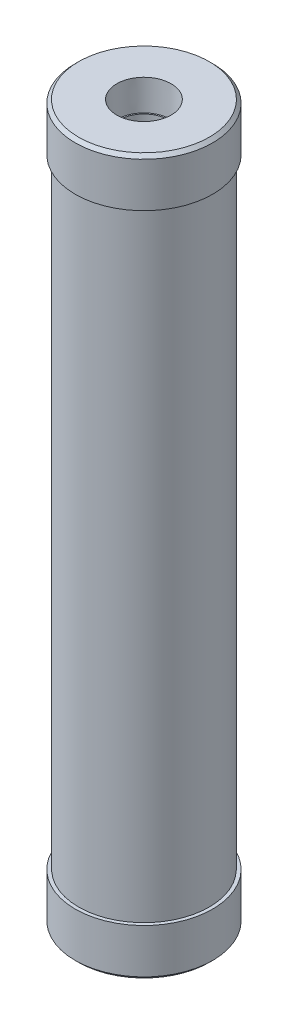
ISO-10303-21;
HEADER;
FILE_DESCRIPTION(('STEP AP214'),'2;1');
FILE_NAME('part.step','',(''),(''),'','','');
FILE_SCHEMA(('AUTOMOTIVE_DESIGN { 1 0 10303 214 1 1 1 1 }'));
ENDSEC;
DATA;
#1=APPLICATION_CONTEXT('core data for automotive mechanical design processes');
#2=APPLICATION_PROTOCOL_DEFINITION('international standard','automotive_design',2000,#1);
#3=PRODUCT_CONTEXT('',#1,'mechanical');
#4=PRODUCT('Part','Part','',(#3));
#5=PRODUCT_RELATED_PRODUCT_CATEGORY('part','',(#4));
#6=PRODUCT_DEFINITION_FORMATION('','',#4);
#7=PRODUCT_DEFINITION_CONTEXT('part definition',#1,'design');
#8=PRODUCT_DEFINITION('design','',#6,#7);
#9=PRODUCT_DEFINITION_SHAPE('','',#8);
#10=(LENGTH_UNIT() NAMED_UNIT(*) SI_UNIT(.MILLI.,.METRE.));
#11=(NAMED_UNIT(*) PLANE_ANGLE_UNIT() SI_UNIT($,.RADIAN.));
#12=(NAMED_UNIT(*) SI_UNIT($,.STERADIAN.) SOLID_ANGLE_UNIT());
#13=UNCERTAINTY_MEASURE_WITH_UNIT(LENGTH_MEASURE(1.E-05),#10,'distance_accuracy_value','');
#14=(GEOMETRIC_REPRESENTATION_CONTEXT(3) GLOBAL_UNCERTAINTY_ASSIGNED_CONTEXT((#13)) GLOBAL_UNIT_ASSIGNED_CONTEXT((#10,
#11,#12)) REPRESENTATION_CONTEXT('',''));
#15=CARTESIAN_POINT('',(0.,0.,0.));
#16=DIRECTION('',(0.,0.,1.));
#17=DIRECTION('',(1.,0.,0.));
#18=AXIS2_PLACEMENT_3D('',#15,#16,#17);
#19=CARTESIAN_POINT('',(0.,330.2,0.));
#20=DIRECTION('',(0.,-1.,0.));
#21=DIRECTION('',(0.,0.,-1.));
#22=AXIS2_PLACEMENT_3D('',#19,#20,#21);
#23=CYLINDRICAL_SURFACE('',#22,30.1625);
#24=CARTESIAN_POINT('',(0.,22.098,0.));
#25=DIRECTION('',(0.,1.,0.));
#26=DIRECTION('',(0.,0.,1.));
#27=AXIS2_PLACEMENT_3D('',#24,#25,#26);
#28=CIRCLE('',#27,30.1625);
#29=CARTESIAN_POINT('',(0.,22.098,30.1625));
#30=VERTEX_POINT('',#29);
#31=EDGE_CURVE('E82',#30,#30,#28,.T.);
#32=ORIENTED_EDGE('',*,*,#31,.T.);
#33=EDGE_LOOP('',(#32));
#34=FACE_BOUND('',#33,.T.);
#35=CARTESIAN_POINT('',(0.,308.102,0.));
#36=DIRECTION('',(0.,1.,0.));
#37=DIRECTION('',(0.,0.,1.));
#38=AXIS2_PLACEMENT_3D('',#35,#36,#37);
#39=CIRCLE('',#38,30.1625);
#40=CARTESIAN_POINT('',(0.,308.102,30.1625));
#41=VERTEX_POINT('',#40);
#42=EDGE_CURVE('E61',#41,#41,#39,.T.);
#43=ORIENTED_EDGE('',*,*,#42,.F.);
#44=EDGE_LOOP('',(#43));
#45=FACE_BOUND('',#44,.T.);
#46=ADVANCED_FACE('F33',(#34,#45),#23,.T.);
#47=CARTESIAN_POINT('',(0.,330.2,0.));
#48=DIRECTION('',(0.,-1.,0.));
#49=DIRECTION('',(0.,0.,-1.));
#50=AXIS2_PLACEMENT_3D('',#47,#48,#49);
#51=CYLINDRICAL_SURFACE('',#50,25.9969);
#52=CARTESIAN_POINT('',(0.,22.098,0.));
#53=DIRECTION('',(0.,1.,0.));
#54=DIRECTION('',(0.,0.,1.));
#55=AXIS2_PLACEMENT_3D('',#52,#53,#54);
#56=CIRCLE('',#55,25.9969);
#57=CARTESIAN_POINT('',(0.,22.098,25.9969));
#58=VERTEX_POINT('',#57);
#59=EDGE_CURVE('E53',#58,#58,#56,.T.);
#60=ORIENTED_EDGE('',*,*,#59,.F.);
#61=EDGE_LOOP('',(#60));
#62=FACE_BOUND('',#61,.T.);
#63=CARTESIAN_POINT('',(0.,308.102,0.));
#64=DIRECTION('',(0.,1.,0.));
#65=DIRECTION('',(0.,0.,1.));
#66=AXIS2_PLACEMENT_3D('',#63,#64,#65);
#67=CIRCLE('',#66,25.9969);
#68=CARTESIAN_POINT('',(0.,308.102,25.9969));
#69=VERTEX_POINT('',#68);
#70=EDGE_CURVE('E67',#69,#69,#67,.T.);
#71=ORIENTED_EDGE('',*,*,#70,.T.);
#72=EDGE_LOOP('',(#71));
#73=FACE_BOUND('',#72,.T.);
#74=ADVANCED_FACE('F117',(#62,#73),#51,.F.);
#75=CARTESIAN_POINT('',(0.,308.102,0.));
#76=DIRECTION('',(0.,1.,0.));
#77=DIRECTION('',(0.,0.,1.));
#78=AXIS2_PLACEMENT_3D('',#75,#76,#77);
#79=PLANE('',#78);
#80=CARTESIAN_POINT('',(0.,308.102,0.));
#81=DIRECTION('',(0.,1.,0.));
#82=DIRECTION('',(0.,0.,1.));
#83=AXIS2_PLACEMENT_3D('',#80,#81,#82);
#84=CIRCLE('',#83,11.5062);
#85=CARTESIAN_POINT('',(0.,308.102,11.5062));
#86=VERTEX_POINT('',#85);
#87=EDGE_CURVE('E62',#86,#86,#84,.T.);
#88=ORIENTED_EDGE('',*,*,#87,.T.);
#89=EDGE_LOOP('',(#88));
#90=FACE_BOUND('',#89,.T.);
#91=ORIENTED_EDGE('',*,*,#70,.F.);
#92=EDGE_LOOP('',(#91));
#93=FACE_BOUND('',#92,.T.);
#94=ADVANCED_FACE('F122',(#90,#93),#79,.F.);
#95=CARTESIAN_POINT('',(0.,308.102,0.));
#96=DIRECTION('',(0.,1.,0.));
#97=DIRECTION('',(0.,0.,1.));
#98=AXIS2_PLACEMENT_3D('',#95,#96,#97);
#99=CIRCLE('',#98,31.75);
#100=CARTESIAN_POINT('',(0.,308.102,31.75));
#101=VERTEX_POINT('',#100);
#102=EDGE_CURVE('E65',#101,#101,#99,.T.);
#103=ORIENTED_EDGE('',*,*,#102,.F.);
#104=EDGE_LOOP('',(#103));
#105=FACE_BOUND('',#104,.T.);
#106=ORIENTED_EDGE('',*,*,#42,.T.);
#107=EDGE_LOOP('',(#106));
#108=FACE_BOUND('',#107,.T.);
#109=ADVANCED_FACE('F168',(#105,#108),#79,.F.);
#110=CARTESIAN_POINT('',(0.,308.102,0.));
#111=DIRECTION('',(0.,1.,0.));
#112=DIRECTION('',(0.,0.,1.));
#113=AXIS2_PLACEMENT_3D('',#110,#111,#112);
#114=CYLINDRICAL_SURFACE('',#113,31.75);
#115=CARTESIAN_POINT('',(0.,328.676,0.));
#116=DIRECTION('',(0.,1.,0.));
#117=DIRECTION('',(0.,0.,1.));
#118=AXIS2_PLACEMENT_3D('',#115,#116,#117);
#119=CIRCLE('',#118,31.75);
#120=CARTESIAN_POINT('',(0.,328.676,31.75));
#121=VERTEX_POINT('',#120);
#122=EDGE_CURVE('E10',#121,#121,#119,.F.);
#123=ORIENTED_EDGE('',*,*,#122,.T.);
#124=EDGE_LOOP('',(#123));
#125=FACE_BOUND('',#124,.T.);
#126=ORIENTED_EDGE('',*,*,#102,.T.);
#127=EDGE_LOOP('',(#126));
#128=FACE_BOUND('',#127,.T.);
#129=ADVANCED_FACE('F170',(#125,#128),#114,.T.);
#130=CARTESIAN_POINT('',(0.,330.2,0.));
#131=DIRECTION('',(0.,1.,0.));
#132=DIRECTION('',(0.,0.,1.));
#133=AXIS2_PLACEMENT_3D('',#130,#131,#132);
#134=PLANE('',#133);
#135=CARTESIAN_POINT('',(0.,330.2,0.));
#136=DIRECTION('',(0.,1.,0.));
#137=DIRECTION('',(0.,0.,1.));
#138=AXIS2_PLACEMENT_3D('',#135,#136,#137);
#139=CIRCLE('',#138,30.226);
#140=CARTESIAN_POINT('',(0.,330.2,30.226));
#141=VERTEX_POINT('',#140);
#142=EDGE_CURVE('E40',#141,#141,#139,.T.);
#143=ORIENTED_EDGE('',*,*,#142,.T.);
#144=EDGE_LOOP('',(#143));
#145=FACE_BOUND('',#144,.T.);
#146=CARTESIAN_POINT('',(0.,330.2,0.));
#147=DIRECTION('',(0.,1.,0.));
#148=DIRECTION('',(0.,0.,1.));
#149=AXIS2_PLACEMENT_3D('',#146,#147,#148);
#150=CIRCLE('',#149,12.5561344);
#151=CARTESIAN_POINT('',(0.,330.2,12.5561344));
#152=VERTEX_POINT('',#151);
#153=EDGE_CURVE('E79',#152,#152,#150,.T.);
#154=ORIENTED_EDGE('',*,*,#153,.F.);
#155=EDGE_LOOP('',(#154));
#156=FACE_BOUND('',#155,.T.);
#157=ADVANCED_FACE('F164',(#145,#156),#134,.T.);
#158=CARTESIAN_POINT('',(0.,330.2,0.));
#159=DIRECTION('',(0.,1.,0.));
#160=DIRECTION('',(0.,0.,1.));
#161=AXIS2_PLACEMENT_3D('',#158,#159,#160);
#162=CYLINDRICAL_SURFACE('',#161,11.5062);
#163=CARTESIAN_POINT('',(0.,316.23,0.));
#164=DIRECTION('',(0.,1.,0.));
#165=DIRECTION('',(0.,0.,1.));
#166=AXIS2_PLACEMENT_3D('',#163,#164,#165);
#167=CIRCLE('',#166,11.5062);
#168=CARTESIAN_POINT('',(0.,316.23,11.5062));
#169=VERTEX_POINT('',#168);
#170=EDGE_CURVE('E66',#169,#169,#167,.T.);
#171=ORIENTED_EDGE('',*,*,#170,.T.);
#172=EDGE_LOOP('',(#171));
#173=FACE_BOUND('',#172,.T.);
#174=ORIENTED_EDGE('',*,*,#87,.F.);
#175=EDGE_LOOP('',(#174));
#176=FACE_BOUND('',#175,.T.);
#177=ADVANCED_FACE('F160',(#173,#176),#162,.F.);
#178=CARTESIAN_POINT('',(11.5062,316.23,0.));
#179=DIRECTION('',(0.,-1.,0.));
#180=DIRECTION('',(0.,0.,-1.));
#181=AXIS2_PLACEMENT_3D('',#178,#179,#180);
#182=PLANE('',#181);
#183=ORIENTED_EDGE('',*,*,#170,.F.);
#184=EDGE_LOOP('',(#183));
#185=FACE_BOUND('',#184,.T.);
#186=CARTESIAN_POINT('',(0.,316.23,0.));
#187=DIRECTION('',(0.,1.,0.));
#188=DIRECTION('',(0.,0.,1.));
#189=AXIS2_PLACEMENT_3D('',#186,#187,#188);
#190=CIRCLE('',#189,12.1378538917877);
#191=CARTESIAN_POINT('',(0.,316.23,12.1378538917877));
#192=VERTEX_POINT('',#191);
#193=EDGE_CURVE('E76',#192,#192,#190,.T.);
#194=ORIENTED_EDGE('',*,*,#193,.T.);
#195=EDGE_LOOP('',(#194));
#196=FACE_BOUND('',#195,.T.);
#197=ADVANCED_FACE('F156',(#185,#196),#182,.F.);
#198=CARTESIAN_POINT('',(0.,330.2,0.));
#199=DIRECTION('',(0.,1.,0.));
#200=DIRECTION('',(0.,0.,1.));
#201=AXIS2_PLACEMENT_3D('',#198,#199,#200);
#202=CONICAL_SURFACE('',#201,12.5561344,0.0299323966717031);
#203=ORIENTED_EDGE('',*,*,#193,.F.);
#204=EDGE_LOOP('',(#203));
#205=FACE_BOUND('',#204,.T.);
#206=ORIENTED_EDGE('',*,*,#153,.T.);
#207=EDGE_LOOP('',(#206));
#208=FACE_BOUND('',#207,.T.);
#209=ADVANCED_FACE('F150',(#205,#208),#202,.F.);
#210=CARTESIAN_POINT('',(0.,22.098,0.));
#211=DIRECTION('',(0.,1.,0.));
#212=DIRECTION('',(0.,0.,1.));
#213=AXIS2_PLACEMENT_3D('',#210,#211,#212);
#214=PLANE('',#213);
#215=CARTESIAN_POINT('',(0.,22.098,0.));
#216=DIRECTION('',(0.,1.,0.));
#217=DIRECTION('',(0.,0.,1.));
#218=AXIS2_PLACEMENT_3D('',#215,#216,#217);
#219=CIRCLE('',#218,11.5062);
#220=CARTESIAN_POINT('',(0.,22.098,11.5062));
#221=VERTEX_POINT('',#220);
#222=EDGE_CURVE('E54',#221,#221,#219,.T.);
#223=ORIENTED_EDGE('',*,*,#222,.F.);
#224=EDGE_LOOP('',(#223));
#225=FACE_BOUND('',#224,.T.);
#226=ORIENTED_EDGE('',*,*,#59,.T.);
#227=EDGE_LOOP('',(#226));
#228=FACE_BOUND('',#227,.T.);
#229=ADVANCED_FACE('F144',(#225,#228),#214,.T.);
#230=CARTESIAN_POINT('',(0.,22.098,0.));
#231=DIRECTION('',(0.,1.,0.));
#232=DIRECTION('',(0.,0.,1.));
#233=AXIS2_PLACEMENT_3D('',#230,#231,#232);
#234=CIRCLE('',#233,31.75);
#235=CARTESIAN_POINT('',(0.,22.098,31.75));
#236=VERTEX_POINT('',#235);
#237=EDGE_CURVE('E57',#236,#236,#234,.T.);
#238=ORIENTED_EDGE('',*,*,#237,.T.);
#239=EDGE_LOOP('',(#238));
#240=FACE_BOUND('',#239,.T.);
#241=ORIENTED_EDGE('',*,*,#31,.F.);
#242=EDGE_LOOP('',(#241));
#243=FACE_BOUND('',#242,.T.);
#244=ADVANCED_FACE('F111',(#240,#243),#214,.T.);
#245=CARTESIAN_POINT('',(0.,22.098,0.));
#246=DIRECTION('',(0.,-1.,0.));
#247=DIRECTION('',(0.,0.,-1.));
#248=AXIS2_PLACEMENT_3D('',#245,#246,#247);
#249=CYLINDRICAL_SURFACE('',#248,31.75);
#250=CARTESIAN_POINT('',(0.,1.524,0.));
#251=DIRECTION('',(0.,1.,0.));
#252=DIRECTION('',(0.,0.,1.));
#253=AXIS2_PLACEMENT_3D('',#250,#251,#252);
#254=CIRCLE('',#253,31.75);
#255=CARTESIAN_POINT('',(0.,1.524,31.75));
#256=VERTEX_POINT('',#255);
#257=EDGE_CURVE('E48',#256,#256,#254,.T.);
#258=ORIENTED_EDGE('',*,*,#257,.T.);
#259=EDGE_LOOP('',(#258));
#260=FACE_BOUND('',#259,.T.);
#261=ORIENTED_EDGE('',*,*,#237,.F.);
#262=EDGE_LOOP('',(#261));
#263=FACE_BOUND('',#262,.T.);
#264=ADVANCED_FACE('F101',(#260,#263),#249,.T.);
#265=CARTESIAN_POINT('',(0.,0.,0.));
#266=DIRECTION('',(0.,1.,0.));
#267=DIRECTION('',(0.,0.,1.));
#268=AXIS2_PLACEMENT_3D('',#265,#266,#267);
#269=PLANE('',#268);
#270=CARTESIAN_POINT('',(0.,0.,0.));
#271=DIRECTION('',(0.,1.,0.));
#272=DIRECTION('',(0.,0.,1.));
#273=AXIS2_PLACEMENT_3D('',#270,#271,#272);
#274=CIRCLE('',#273,30.226);
#275=CARTESIAN_POINT('',(0.,0.,30.226));
#276=VERTEX_POINT('',#275);
#277=EDGE_CURVE('E44',#276,#276,#274,.F.);
#278=ORIENTED_EDGE('',*,*,#277,.T.);
#279=EDGE_LOOP('',(#278));
#280=FACE_BOUND('',#279,.T.);
#281=CARTESIAN_POINT('',(0.,0.,0.));
#282=DIRECTION('',(0.,-1.,0.));
#283=DIRECTION('',(0.,0.,-1.));
#284=AXIS2_PLACEMENT_3D('',#281,#282,#283);
#285=CIRCLE('',#284,12.5561344);
#286=CARTESIAN_POINT('',(0.,0.,-12.5561344));
#287=VERTEX_POINT('',#286);
#288=EDGE_CURVE('E92',#287,#287,#285,.T.);
#289=ORIENTED_EDGE('',*,*,#288,.F.);
#290=EDGE_LOOP('',(#289));
#291=FACE_BOUND('',#290,.T.);
#292=ADVANCED_FACE('F98',(#280,#291),#269,.F.);
#293=CARTESIAN_POINT('',(0.,0.,0.));
#294=DIRECTION('',(0.,-1.,0.));
#295=DIRECTION('',(0.,0.,-1.));
#296=AXIS2_PLACEMENT_3D('',#293,#294,#295);
#297=CYLINDRICAL_SURFACE('',#296,11.5062);
#298=ORIENTED_EDGE('',*,*,#222,.T.);
#299=EDGE_LOOP('',(#298));
#300=FACE_BOUND('',#299,.T.);
#301=CARTESIAN_POINT('',(0.,13.97,0.));
#302=DIRECTION('',(0.,-1.,0.));
#303=DIRECTION('',(0.,0.,-1.));
#304=AXIS2_PLACEMENT_3D('',#301,#302,#303);
#305=CIRCLE('',#304,11.5062);
#306=CARTESIAN_POINT('',(0.,13.97,-11.5062));
#307=VERTEX_POINT('',#306);
#308=EDGE_CURVE('E58',#307,#307,#305,.T.);
#309=ORIENTED_EDGE('',*,*,#308,.T.);
#310=EDGE_LOOP('',(#309));
#311=FACE_BOUND('',#310,.T.);
#312=ADVANCED_FACE('F100',(#300,#311),#297,.F.);
#313=CARTESIAN_POINT('',(11.5062,13.97,0.));
#314=DIRECTION('',(0.,1.,0.));
#315=DIRECTION('',(0.,0.,1.));
#316=AXIS2_PLACEMENT_3D('',#313,#314,#315);
#317=PLANE('',#316);
#318=ORIENTED_EDGE('',*,*,#308,.F.);
#319=EDGE_LOOP('',(#318));
#320=FACE_BOUND('',#319,.T.);
#321=CARTESIAN_POINT('',(0.,13.97,0.));
#322=DIRECTION('',(0.,-1.,0.));
#323=DIRECTION('',(0.,0.,-1.));
#324=AXIS2_PLACEMENT_3D('',#321,#322,#323);
#325=CIRCLE('',#324,12.1378538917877);
#326=CARTESIAN_POINT('',(0.,13.97,-12.1378538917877));
#327=VERTEX_POINT('',#326);
#328=EDGE_CURVE('E89',#327,#327,#325,.T.);
#329=ORIENTED_EDGE('',*,*,#328,.T.);
#330=EDGE_LOOP('',(#329));
#331=FACE_BOUND('',#330,.T.);
#332=ADVANCED_FACE('F108',(#320,#331),#317,.F.);
#333=CARTESIAN_POINT('',(0.,0.,0.));
#334=DIRECTION('',(0.,-1.,0.));
#335=DIRECTION('',(0.,0.,-1.));
#336=AXIS2_PLACEMENT_3D('',#333,#334,#335);
#337=CONICAL_SURFACE('',#336,12.5561344,0.0299323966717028);
#338=ORIENTED_EDGE('',*,*,#328,.F.);
#339=EDGE_LOOP('',(#338));
#340=FACE_BOUND('',#339,.T.);
#341=ORIENTED_EDGE('',*,*,#288,.T.);
#342=EDGE_LOOP('',(#341));
#343=FACE_BOUND('',#342,.T.);
#344=ADVANCED_FACE('F96',(#340,#343),#337,.F.);
#345=CARTESIAN_POINT('',(0.,1.524,0.));
#346=DIRECTION('',(0.,1.,0.));
#347=DIRECTION('',(0.,0.,1.));
#348=AXIS2_PLACEMENT_3D('',#345,#346,#347);
#349=CONICAL_SURFACE('',#348,31.75,0.785398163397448);
#350=ORIENTED_EDGE('',*,*,#277,.F.);
#351=EDGE_LOOP('',(#350));
#352=FACE_BOUND('',#351,.T.);
#353=ORIENTED_EDGE('',*,*,#257,.F.);
#354=EDGE_LOOP('',(#353));
#355=FACE_BOUND('',#354,.T.);
#356=ADVANCED_FACE('F126',(#352,#355),#349,.T.);
#357=CARTESIAN_POINT('',(0.,330.2,0.));
#358=DIRECTION('',(0.,-1.,0.));
#359=DIRECTION('',(0.,0.,-1.));
#360=AXIS2_PLACEMENT_3D('',#357,#358,#359);
#361=CONICAL_SURFACE('',#360,30.226,0.78539816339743);
#362=ORIENTED_EDGE('',*,*,#122,.F.);
#363=EDGE_LOOP('',(#362));
#364=FACE_BOUND('',#363,.T.);
#365=ORIENTED_EDGE('',*,*,#142,.F.);
#366=EDGE_LOOP('',(#365));
#367=FACE_BOUND('',#366,.T.);
#368=ADVANCED_FACE('F35',(#364,#367),#361,.T.);
#369=CLOSED_SHELL('',(#46,#74,#94,#109,#129,#157,#177,#197,#209,#229,#244,#264,#292,#312,#332,
#344,#356,#368));
#370=MANIFOLD_SOLID_BREP('B2',#369);
#371=ADVANCED_BREP_SHAPE_REPRESENTATION('',(#18,#370),#14);
#372=SHAPE_DEFINITION_REPRESENTATION(#9,#371);
ENDSEC;
END-ISO-10303-21;
